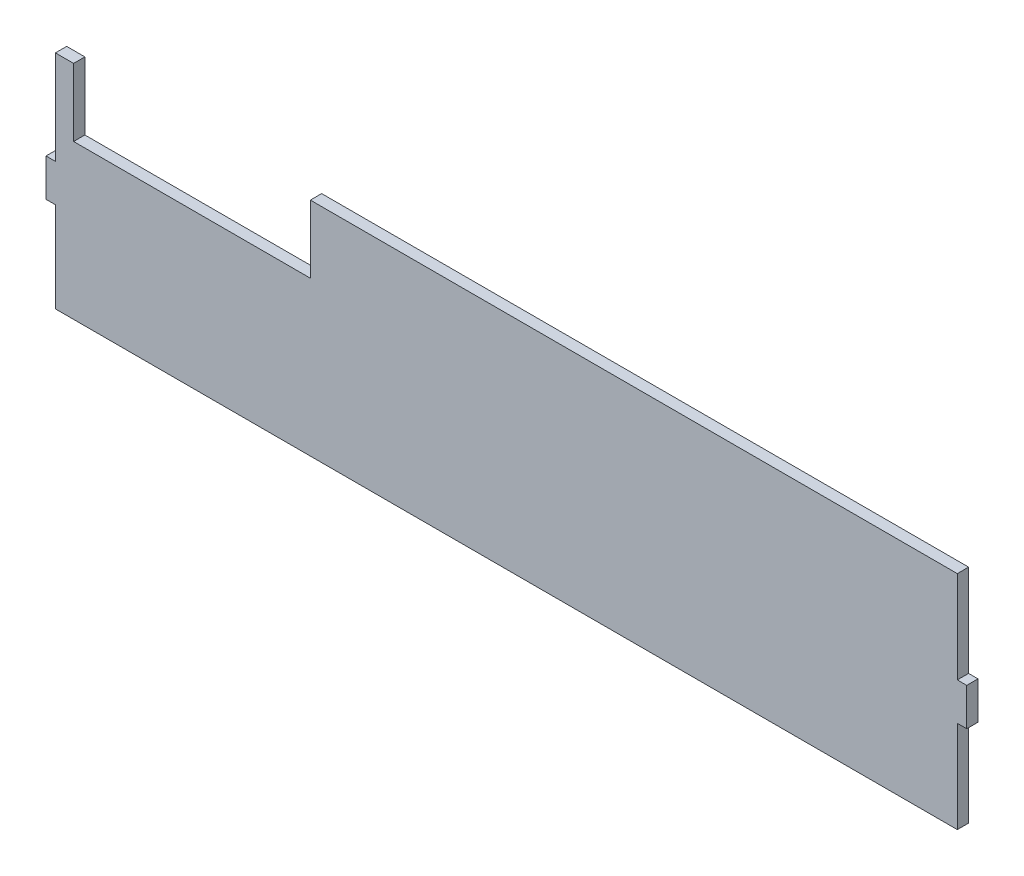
from build123d import *

# Parameters (mm, degrees)
EXTRUDE1_DEPTH     = 3.81
SKETCH2_W          = 80.01
SKETCH2_H          = 22.86
CUT_EXTRUDE1_DEPTH = 203.711531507


with BuildPart() as part:
    # Sketch1 → Extrude1 (new body)
    with BuildSketch(Plane.XY):
        Polygon((-110.233637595, 12.7), (-110.233637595, 44.45), (194.566362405, 44.45), (194.566362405, 13.335), (197.741362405, 13.335), (197.741362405, 0.635), (194.566362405, 0.635), (194.566362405, -30.48), (-110.233637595, -30.48), (-110.233637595, 0), (-113.408637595, 0), (-113.408637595, 12.7), align=None)
    extrude(amount=EXTRUDE1_DEPTH)

    # Sketch2 → Cut-Extrude1 (cut, through all)
    with BuildSketch(Plane.XY.offset(3.81)):
        with Locations((-64.074993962, 33.02)):
            Rectangle(SKETCH2_W, SKETCH2_H)
    extrude(amount=-CUT_EXTRUDE1_DEPTH, mode=Mode.SUBTRACT)


solid = part.part
